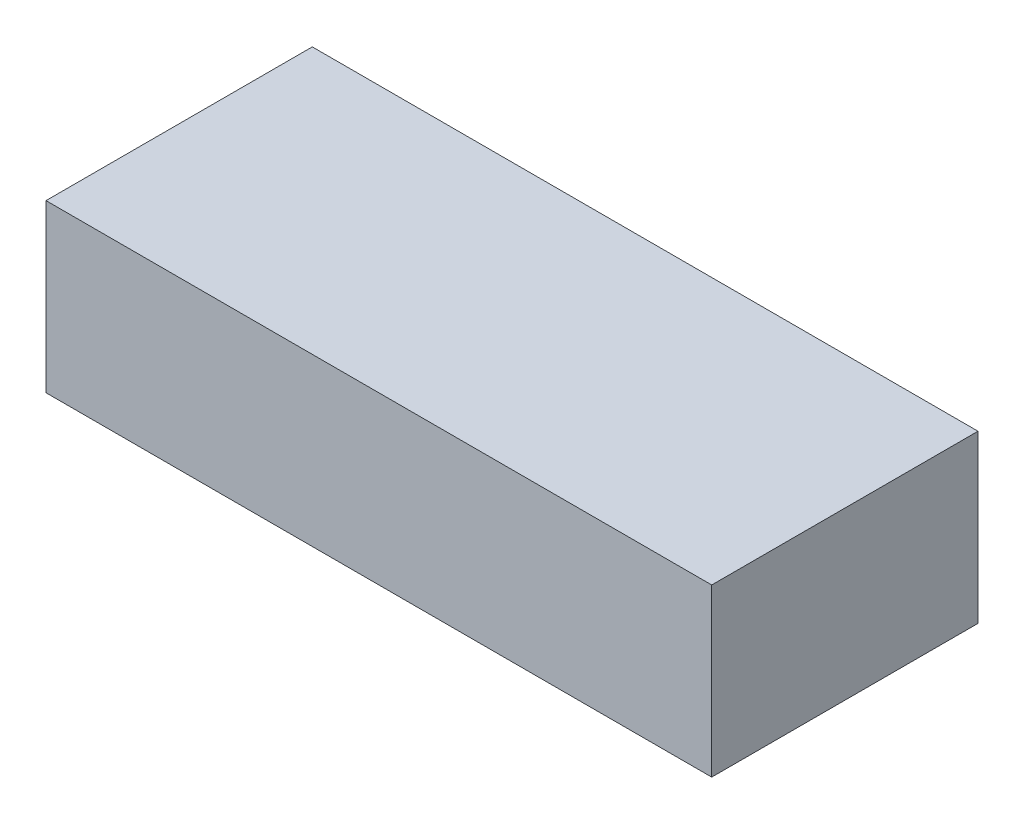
from build123d import *

# Parameters (mm, degrees)
ESQUISSE1_W      = 20
ESQUISSE1_H      = 5
EXTRUSION1_DEPTH = 8


with BuildPart() as part:
    # Esquisse1 → Extrusion1 (new body)
    with BuildSketch(Plane.XY):
        with Locations((10, 2.5)):
            Rectangle(ESQUISSE1_W, ESQUISSE1_H)
    extrude(amount=EXTRUSION1_DEPTH)


solid = part.part
